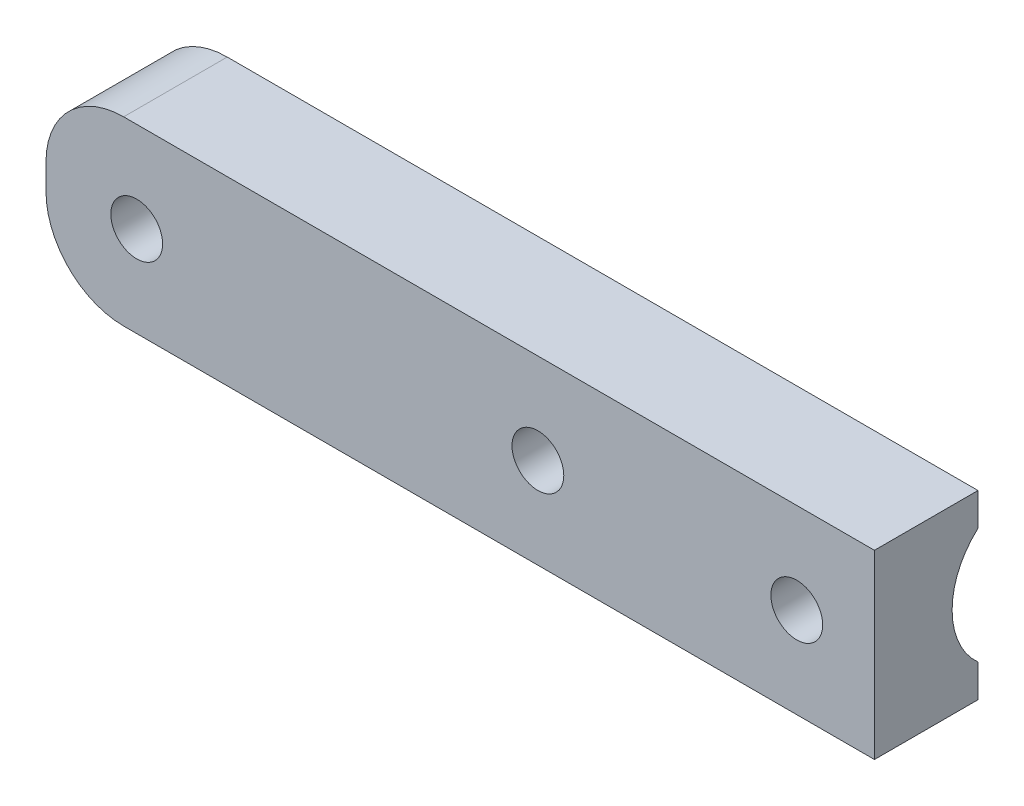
ISO-10303-21;
HEADER;
FILE_DESCRIPTION(('STEP AP214'),'2;1');
FILE_NAME('part.step','',(''),(''),'','','');
FILE_SCHEMA(('AUTOMOTIVE_DESIGN { 1 0 10303 214 1 1 1 1 }'));
ENDSEC;
DATA;
#1=APPLICATION_CONTEXT('core data for automotive mechanical design processes');
#2=APPLICATION_PROTOCOL_DEFINITION('international standard','automotive_design',2000,#1);
#3=PRODUCT_CONTEXT('',#1,'mechanical');
#4=PRODUCT('Part','Part','',(#3));
#5=PRODUCT_RELATED_PRODUCT_CATEGORY('part','',(#4));
#6=PRODUCT_DEFINITION_FORMATION('','',#4);
#7=PRODUCT_DEFINITION_CONTEXT('part definition',#1,'design');
#8=PRODUCT_DEFINITION('design','',#6,#7);
#9=PRODUCT_DEFINITION_SHAPE('','',#8);
#10=(LENGTH_UNIT() NAMED_UNIT(*) SI_UNIT(.MILLI.,.METRE.));
#11=(NAMED_UNIT(*) PLANE_ANGLE_UNIT() SI_UNIT($,.RADIAN.));
#12=(NAMED_UNIT(*) SI_UNIT($,.STERADIAN.) SOLID_ANGLE_UNIT());
#13=UNCERTAINTY_MEASURE_WITH_UNIT(LENGTH_MEASURE(1.E-05),#10,'distance_accuracy_value','');
#14=(GEOMETRIC_REPRESENTATION_CONTEXT(3) GLOBAL_UNCERTAINTY_ASSIGNED_CONTEXT((#13)) GLOBAL_UNIT_ASSIGNED_CONTEXT((#10,
#11,#12)) REPRESENTATION_CONTEXT('',''));
#15=CARTESIAN_POINT('',(0.,0.,0.));
#16=DIRECTION('',(0.,0.,1.));
#17=DIRECTION('',(1.,0.,0.));
#18=AXIS2_PLACEMENT_3D('',#15,#16,#17);
#19=CARTESIAN_POINT('',(0.,0.,6.35));
#20=DIRECTION('',(0.,0.,1.));
#21=DIRECTION('',(1.,0.,0.));
#22=AXIS2_PLACEMENT_3D('',#19,#20,#21);
#23=PLANE('',#22);
#24=CARTESIAN_POINT('',(80.9498,0.,6.35));
#25=DIRECTION('',(0.,0.,1.));
#26=DIRECTION('',(1.,0.,0.));
#27=AXIS2_PLACEMENT_3D('',#24,#25,#26);
#28=CIRCLE('',#27,3.175);
#29=CARTESIAN_POINT('',(84.1248,0.,6.35));
#30=VERTEX_POINT('',#29);
#31=EDGE_CURVE('E128',#30,#30,#28,.T.);
#32=ORIENTED_EDGE('',*,*,#31,.F.);
#33=EDGE_LOOP('',(#32));
#34=FACE_BOUND('',#33,.T.);
#35=DIRECTION('',(0.,-1.,0.));
#36=VECTOR('',#35,1.);
#37=CARTESIAN_POINT('',(-11.1252,11.1125,6.35));
#38=LINE('',#37,#36);
#39=CARTESIAN_POINT('',(-11.1252,1.5875,6.35));
#40=VERTEX_POINT('',#39);
#41=CARTESIAN_POINT('',(-11.1252,-1.5875,6.35));
#42=VERTEX_POINT('',#41);
#43=EDGE_CURVE('E135',#40,#42,#38,.T.);
#44=ORIENTED_EDGE('',*,*,#43,.T.);
#45=CARTESIAN_POINT('',(-1.6002,-1.5875,6.35));
#46=DIRECTION('',(0.,0.,1.));
#47=DIRECTION('',(1.,0.,0.));
#48=AXIS2_PLACEMENT_3D('',#45,#46,#47);
#49=CIRCLE('',#48,9.525);
#50=CARTESIAN_POINT('',(-1.6002,-11.1125,6.35));
#51=VERTEX_POINT('',#50);
#52=EDGE_CURVE('E173',#42,#51,#49,.T.);
#53=ORIENTED_EDGE('',*,*,#52,.T.);
#54=DIRECTION('',(1.,0.,0.));
#55=VECTOR('',#54,1.);
#56=CARTESIAN_POINT('',(-11.1252,-11.1125,6.35));
#57=LINE('',#56,#55);
#58=CARTESIAN_POINT('',(90.4748,-11.1125,6.35));
#59=VERTEX_POINT('',#58);
#60=EDGE_CURVE('E138',#51,#59,#57,.T.);
#61=ORIENTED_EDGE('',*,*,#60,.T.);
#62=DIRECTION('',(0.,1.,0.));
#63=VECTOR('',#62,1.);
#64=CARTESIAN_POINT('',(90.4748,-11.1125,6.35));
#65=LINE('',#64,#63);
#66=CARTESIAN_POINT('',(90.4748,11.1125,6.35));
#67=VERTEX_POINT('',#66);
#68=EDGE_CURVE('E141',#59,#67,#65,.T.);
#69=ORIENTED_EDGE('',*,*,#68,.T.);
#70=DIRECTION('',(-1.,0.,0.));
#71=VECTOR('',#70,1.);
#72=CARTESIAN_POINT('',(90.4748,11.1125,6.35));
#73=LINE('',#72,#71);
#74=CARTESIAN_POINT('',(-1.6002,11.1125,6.35));
#75=VERTEX_POINT('',#74);
#76=EDGE_CURVE('E143',#67,#75,#73,.T.);
#77=ORIENTED_EDGE('',*,*,#76,.T.);
#78=CARTESIAN_POINT('',(-1.6002,1.5875,6.35));
#79=DIRECTION('',(0.,0.,1.));
#80=DIRECTION('',(1.,0.,0.));
#81=AXIS2_PLACEMENT_3D('',#78,#79,#80);
#82=CIRCLE('',#81,9.525);
#83=EDGE_CURVE('E171',#75,#40,#82,.T.);
#84=ORIENTED_EDGE('',*,*,#83,.T.);
#85=EDGE_LOOP('',(#44,#53,#61,#69,#77,#84));
#86=FACE_BOUND('',#85,.T.);
#87=CARTESIAN_POINT('',(0.,0.,6.35));
#88=DIRECTION('',(0.,0.,1.));
#89=DIRECTION('',(1.,0.,0.));
#90=AXIS2_PLACEMENT_3D('',#87,#88,#89);
#91=CIRCLE('',#90,3.175);
#92=CARTESIAN_POINT('',(3.175,0.,6.35));
#93=VERTEX_POINT('',#92);
#94=EDGE_CURVE('E131',#93,#93,#91,.T.);
#95=ORIENTED_EDGE('',*,*,#94,.F.);
#96=EDGE_LOOP('',(#95));
#97=FACE_BOUND('',#96,.T.);
#98=CARTESIAN_POINT('',(49.1998,0.,6.35));
#99=DIRECTION('',(0.,0.,1.));
#100=DIRECTION('',(1.,0.,0.));
#101=AXIS2_PLACEMENT_3D('',#98,#99,#100);
#102=CIRCLE('',#101,3.17500000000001);
#103=CARTESIAN_POINT('',(52.3748,0.,6.35));
#104=VERTEX_POINT('',#103);
#105=EDGE_CURVE('E116',#104,#104,#102,.T.);
#106=ORIENTED_EDGE('',*,*,#105,.F.);
#107=EDGE_LOOP('',(#106));
#108=FACE_BOUND('',#107,.T.);
#109=ADVANCED_FACE('F33',(#34,#86,#97,#108),#23,.T.);
#110=CARTESIAN_POINT('',(0.,0.,-6.35));
#111=DIRECTION('',(0.,0.,1.));
#112=DIRECTION('',(1.,0.,0.));
#113=AXIS2_PLACEMENT_3D('',#110,#111,#112);
#114=PLANE('',#113);
#115=CARTESIAN_POINT('',(0.,0.,-6.35));
#116=DIRECTION('',(0.,0.,1.));
#117=DIRECTION('',(1.,0.,0.));
#118=AXIS2_PLACEMENT_3D('',#115,#116,#117);
#119=CIRCLE('',#118,9.525);
#120=CARTESIAN_POINT('',(9.525,0.,-6.35));
#121=VERTEX_POINT('',#120);
#122=EDGE_CURVE('E37',#121,#121,#119,.T.);
#123=ORIENTED_EDGE('',*,*,#122,.T.);
#124=EDGE_LOOP('',(#123));
#125=FACE_BOUND('',#124,.T.);
#126=DIRECTION('',(0.,1.,0.));
#127=VECTOR('',#126,1.);
#128=CARTESIAN_POINT('',(39.6748,0.,-6.35));
#129=LINE('',#128,#127);
#130=CARTESIAN_POINT('',(39.6748,-7.09951582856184,-6.35));
#131=VERTEX_POINT('',#130);
#132=CARTESIAN_POINT('',(39.6748,7.09951582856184,-6.35));
#133=VERTEX_POINT('',#132);
#134=EDGE_CURVE('E11',#131,#133,#129,.T.);
#135=ORIENTED_EDGE('',*,*,#134,.F.);
#136=DIRECTION('',(1.,0.,0.));
#137=VECTOR('',#136,1.);
#138=CARTESIAN_POINT('',(39.6748,-7.09951582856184,-6.35));
#139=LINE('',#138,#137);
#140=CARTESIAN_POINT('',(90.4748,-7.09951582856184,-6.35));
#141=VERTEX_POINT('',#140);
#142=EDGE_CURVE('E106',#131,#141,#139,.T.);
#143=ORIENTED_EDGE('',*,*,#142,.T.);
#144=DIRECTION('',(0.,1.,0.));
#145=VECTOR('',#144,1.);
#146=CARTESIAN_POINT('',(90.4748,-11.1125,-6.35));
#147=LINE('',#146,#145);
#148=CARTESIAN_POINT('',(90.4748,-11.1125,-6.35));
#149=VERTEX_POINT('',#148);
#150=EDGE_CURVE('E150',#149,#141,#147,.T.);
#151=ORIENTED_EDGE('',*,*,#150,.F.);
#152=DIRECTION('',(1.,0.,0.));
#153=VECTOR('',#152,1.);
#154=CARTESIAN_POINT('',(-11.1252,-11.1125,-6.35));
#155=LINE('',#154,#153);
#156=CARTESIAN_POINT('',(-1.6002,-11.1125,-6.35));
#157=VERTEX_POINT('',#156);
#158=EDGE_CURVE('E148',#157,#149,#155,.T.);
#159=ORIENTED_EDGE('',*,*,#158,.F.);
#160=CARTESIAN_POINT('',(-1.6002,-1.5875,-6.35));
#161=DIRECTION('',(0.,0.,1.));
#162=DIRECTION('',(1.,0.,0.));
#163=AXIS2_PLACEMENT_3D('',#160,#161,#162);
#164=CIRCLE('',#163,9.525);
#165=CARTESIAN_POINT('',(-11.1252,-1.5875,-6.35));
#166=VERTEX_POINT('',#165);
#167=EDGE_CURVE('E164',#157,#166,#164,.F.);
#168=ORIENTED_EDGE('',*,*,#167,.T.);
#169=DIRECTION('',(0.,-1.,0.));
#170=VECTOR('',#169,1.);
#171=CARTESIAN_POINT('',(-11.1252,11.1125,-6.35));
#172=LINE('',#171,#170);
#173=CARTESIAN_POINT('',(-11.1252,1.5875,-6.35));
#174=VERTEX_POINT('',#173);
#175=EDGE_CURVE('E134',#174,#166,#172,.T.);
#176=ORIENTED_EDGE('',*,*,#175,.F.);
#177=CARTESIAN_POINT('',(-1.6002,1.5875,-6.35));
#178=DIRECTION('',(0.,0.,1.));
#179=DIRECTION('',(1.,0.,0.));
#180=AXIS2_PLACEMENT_3D('',#177,#178,#179);
#181=CIRCLE('',#180,9.525);
#182=CARTESIAN_POINT('',(-1.6002,11.1125,-6.35));
#183=VERTEX_POINT('',#182);
#184=EDGE_CURVE('E162',#174,#183,#181,.F.);
#185=ORIENTED_EDGE('',*,*,#184,.T.);
#186=DIRECTION('',(-1.,0.,0.));
#187=VECTOR('',#186,1.);
#188=CARTESIAN_POINT('',(90.4748,11.1125,-6.35));
#189=LINE('',#188,#187);
#190=CARTESIAN_POINT('',(90.4748,11.1125,-6.35));
#191=VERTEX_POINT('',#190);
#192=EDGE_CURVE('E139',#191,#183,#189,.T.);
#193=ORIENTED_EDGE('',*,*,#192,.F.);
#194=CARTESIAN_POINT('',(90.4748,7.09951582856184,-6.35));
#195=VERTEX_POINT('',#194);
#196=EDGE_CURVE('E113',#195,#191,#147,.T.);
#197=ORIENTED_EDGE('',*,*,#196,.F.);
#198=DIRECTION('',(1.,0.,0.));
#199=VECTOR('',#198,1.);
#200=CARTESIAN_POINT('',(39.6748,7.09951582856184,-6.35));
#201=LINE('',#200,#199);
#202=EDGE_CURVE('E50',#195,#133,#201,.F.);
#203=ORIENTED_EDGE('',*,*,#202,.T.);
#204=EDGE_LOOP('',(#135,#143,#151,#159,#168,#176,#185,#193,#197,#203));
#205=FACE_BOUND('',#204,.T.);
#206=ADVANCED_FACE('F111',(#125,#205),#114,.F.);
#207=CARTESIAN_POINT('',(-11.1252,11.1125,6.35));
#208=DIRECTION('',(1.,0.,0.));
#209=DIRECTION('',(0.,0.,-1.));
#210=AXIS2_PLACEMENT_3D('',#207,#208,#209);
#211=PLANE('',#210);
#212=ORIENTED_EDGE('',*,*,#175,.T.);
#213=DIRECTION('',(0.,0.,-1.));
#214=VECTOR('',#213,1.);
#215=CARTESIAN_POINT('',(-11.1252,-1.5875,6.35));
#216=LINE('',#215,#214);
#217=EDGE_CURVE('E169',#166,#42,#216,.F.);
#218=ORIENTED_EDGE('',*,*,#217,.T.);
#219=ORIENTED_EDGE('',*,*,#43,.F.);
#220=DIRECTION('',(0.,0.,-1.));
#221=VECTOR('',#220,1.);
#222=CARTESIAN_POINT('',(-11.1252,1.5875,6.35));
#223=LINE('',#222,#221);
#224=EDGE_CURVE('E166',#40,#174,#223,.T.);
#225=ORIENTED_EDGE('',*,*,#224,.T.);
#226=EDGE_LOOP('',(#212,#218,#219,#225));
#227=FACE_BOUND('',#226,.T.);
#228=ADVANCED_FACE('F206',(#227),#211,.F.);
#229=CARTESIAN_POINT('',(-11.1252,-11.1125,6.35));
#230=DIRECTION('',(0.,1.,0.));
#231=DIRECTION('',(0.,0.,1.));
#232=AXIS2_PLACEMENT_3D('',#229,#230,#231);
#233=PLANE('',#232);
#234=ORIENTED_EDGE('',*,*,#60,.F.);
#235=DIRECTION('',(0.,0.,-1.));
#236=VECTOR('',#235,1.);
#237=CARTESIAN_POINT('',(-1.6002,-11.1125,6.35));
#238=LINE('',#237,#236);
#239=EDGE_CURVE('E159',#51,#157,#238,.T.);
#240=ORIENTED_EDGE('',*,*,#239,.T.);
#241=ORIENTED_EDGE('',*,*,#158,.T.);
#242=DIRECTION('',(0.,0.,-1.));
#243=VECTOR('',#242,1.);
#244=CARTESIAN_POINT('',(90.4748,-11.1125,6.35));
#245=LINE('',#244,#243);
#246=EDGE_CURVE('E156',#59,#149,#245,.T.);
#247=ORIENTED_EDGE('',*,*,#246,.F.);
#248=EDGE_LOOP('',(#234,#240,#241,#247));
#249=FACE_BOUND('',#248,.T.);
#250=ADVANCED_FACE('F220',(#249),#233,.F.);
#251=CARTESIAN_POINT('',(90.4748,-11.1125,6.35));
#252=DIRECTION('',(-1.,0.,0.));
#253=DIRECTION('',(0.,0.,1.));
#254=AXIS2_PLACEMENT_3D('',#251,#252,#253);
#255=PLANE('',#254);
#256=ORIENTED_EDGE('',*,*,#150,.T.);
#257=CARTESIAN_POINT('',(90.4748,0.,-12.7));
#258=DIRECTION('',(1.,0.,0.));
#259=DIRECTION('',(0.,0.,-1.));
#260=AXIS2_PLACEMENT_3D('',#257,#258,#259);
#261=CIRCLE('',#260,9.525);
#262=EDGE_CURVE('E108',#195,#141,#261,.T.);
#263=ORIENTED_EDGE('',*,*,#262,.F.);
#264=ORIENTED_EDGE('',*,*,#196,.T.);
#265=DIRECTION('',(0.,0.,-1.));
#266=VECTOR('',#265,1.);
#267=CARTESIAN_POINT('',(90.4748,11.1125,6.35));
#268=LINE('',#267,#266);
#269=EDGE_CURVE('E145',#67,#191,#268,.T.);
#270=ORIENTED_EDGE('',*,*,#269,.F.);
#271=ORIENTED_EDGE('',*,*,#68,.F.);
#272=ORIENTED_EDGE('',*,*,#246,.T.);
#273=EDGE_LOOP('',(#256,#263,#264,#270,#271,#272));
#274=FACE_BOUND('',#273,.T.);
#275=ADVANCED_FACE('F217',(#274),#255,.F.);
#276=CARTESIAN_POINT('',(90.4748,11.1125,6.35));
#277=DIRECTION('',(0.,-1.,0.));
#278=DIRECTION('',(0.,0.,-1.));
#279=AXIS2_PLACEMENT_3D('',#276,#277,#278);
#280=PLANE('',#279);
#281=ORIENTED_EDGE('',*,*,#192,.T.);
#282=DIRECTION('',(0.,0.,-1.));
#283=VECTOR('',#282,1.);
#284=CARTESIAN_POINT('',(-1.6002,11.1125,6.35));
#285=LINE('',#284,#283);
#286=EDGE_CURVE('E42',#183,#75,#285,.F.);
#287=ORIENTED_EDGE('',*,*,#286,.T.);
#288=ORIENTED_EDGE('',*,*,#76,.F.);
#289=ORIENTED_EDGE('',*,*,#269,.T.);
#290=EDGE_LOOP('',(#281,#287,#288,#289));
#291=FACE_BOUND('',#290,.T.);
#292=ADVANCED_FACE('F214',(#291),#280,.F.);
#293=CARTESIAN_POINT('',(0.,0.,6.35));
#294=DIRECTION('',(0.,0.,-1.));
#295=DIRECTION('',(-1.,0.,0.));
#296=AXIS2_PLACEMENT_3D('',#293,#294,#295);
#297=CYLINDRICAL_SURFACE('',#296,3.175);
#298=CARTESIAN_POINT('',(0.,0.,-2.54));
#299=DIRECTION('',(0.,0.,1.));
#300=DIRECTION('',(1.,0.,0.));
#301=AXIS2_PLACEMENT_3D('',#298,#299,#300);
#302=CIRCLE('',#301,3.175);
#303=CARTESIAN_POINT('',(3.175,0.,-2.54));
#304=VERTEX_POINT('',#303);
#305=EDGE_CURVE('E252',#304,#304,#302,.T.);
#306=ORIENTED_EDGE('',*,*,#305,.F.);
#307=EDGE_LOOP('',(#306));
#308=FACE_BOUND('',#307,.T.);
#309=ORIENTED_EDGE('',*,*,#94,.T.);
#310=EDGE_LOOP('',(#309));
#311=FACE_BOUND('',#310,.T.);
#312=ADVANCED_FACE('F212',(#308,#311),#297,.F.);
#313=CARTESIAN_POINT('',(80.9498,0.,6.35));
#314=DIRECTION('',(0.,0.,-1.));
#315=DIRECTION('',(-1.,0.,0.));
#316=AXIS2_PLACEMENT_3D('',#313,#314,#315);
#317=CYLINDRICAL_SURFACE('',#316,3.175);
#318=CARTESIAN_POINT('',(77.7748,0.,-3.17499999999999));
#319=CARTESIAN_POINT('',(77.774799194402,-0.173238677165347,-3.17499951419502));
#320=CARTESIAN_POINT('',(77.7890248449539,-0.346472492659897,-3.17976981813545));
#321=CARTESIAN_POINT('',(77.8453774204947,-0.687837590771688,-3.19832957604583));
#322=CARTESIAN_POINT('',(77.8875072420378,-0.855968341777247,-3.21211996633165));
#323=CARTESIAN_POINT('',(77.9980635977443,-1.18215660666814,-3.24722147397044));
#324=CARTESIAN_POINT('',(78.0664461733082,-1.34023044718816,-3.2685200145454));
#325=CARTESIAN_POINT('',(78.2273682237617,-1.64266542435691,-3.31646384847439));
#326=CARTESIAN_POINT('',(78.3199124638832,-1.78702384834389,-3.34311019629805));
#327=CARTESIAN_POINT('',(78.5298969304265,-2.0629298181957,-3.39997750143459));
#328=CARTESIAN_POINT('',(78.6480241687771,-2.19393674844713,-3.43028408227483));
#329=CARTESIAN_POINT('',(78.9043607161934,-2.43469379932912,-3.49058500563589));
#330=CARTESIAN_POINT('',(79.042574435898,-2.54443923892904,-3.52057927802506));
#331=CARTESIAN_POINT('',(79.3400277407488,-2.74264419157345,-3.57780169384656));
#332=CARTESIAN_POINT('',(79.4997576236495,-2.83040092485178,-3.6049255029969));
#333=CARTESIAN_POINT('',(79.8327590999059,-2.97757492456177,-3.65203405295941));
#334=CARTESIAN_POINT('',(80.0060265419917,-3.03700083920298,-3.67202097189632));
#335=CARTESIAN_POINT('',(80.3550374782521,-3.12379824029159,-3.70169112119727));
#336=CARTESIAN_POINT('',(80.5305006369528,-3.15218269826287,-3.71169895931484));
#337=CARTESIAN_POINT('',(80.8839624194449,-3.17925806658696,-3.72123790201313));
#338=CARTESIAN_POINT('',(81.0619602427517,-3.17795815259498,-3.72077224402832));
#339=CARTESIAN_POINT('',(81.4067988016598,-3.14648819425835,-3.70970127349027));
#340=CARTESIAN_POINT('',(81.5737776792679,-3.11764017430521,-3.69956029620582));
#341=CARTESIAN_POINT('',(81.9003741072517,-3.0340495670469,-3.6710411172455));
#342=CARTESIAN_POINT('',(82.0599907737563,-2.97930387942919,-3.65266192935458));
#343=CARTESIAN_POINT('',(82.3703354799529,-2.84460650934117,-3.60940632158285));
#344=CARTESIAN_POINT('',(82.5208789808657,-2.76426310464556,-3.58443003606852));
#345=CARTESIAN_POINT('',(82.8067651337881,-2.58092291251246,-3.53083626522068));
#346=CARTESIAN_POINT('',(82.9421033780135,-2.47791958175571,-3.50221772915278));
#347=CARTESIAN_POINT('',(83.2011658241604,-2.2458341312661,-3.44273729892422));
#348=CARTESIAN_POINT('',(83.3239148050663,-2.11567125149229,-3.41183628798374));
#349=CARTESIAN_POINT('',(83.5460967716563,-1.83622813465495,-3.35257970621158));
#350=CARTESIAN_POINT('',(83.6455275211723,-1.68694606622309,-3.32422437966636));
#351=CARTESIAN_POINT('',(83.8190357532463,-1.3714336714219,-3.27288182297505));
#352=CARTESIAN_POINT('',(83.8928519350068,-1.20504990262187,-3.24995063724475));
#353=CARTESIAN_POINT('',(84.0111450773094,-0.861279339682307,-3.21244699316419));
#354=CARTESIAN_POINT('',(84.0556322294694,-0.683896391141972,-3.19787163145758));
#355=CARTESIAN_POINT('',(84.112276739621,-0.331418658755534,-3.17920284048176));
#356=CARTESIAN_POINT('',(84.1257518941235,-0.156557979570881,-3.17468244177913));
#357=CARTESIAN_POINT('',(84.1237437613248,0.192960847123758,-3.17535233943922));
#358=CARTESIAN_POINT('',(84.1082653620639,0.367619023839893,-3.18054099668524));
#359=CARTESIAN_POINT('',(84.0498321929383,0.706500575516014,-3.19976421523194));
#360=CARTESIAN_POINT('',(84.0076862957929,0.870879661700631,-3.21353819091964));
#361=CARTESIAN_POINT('',(83.8981258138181,1.19016766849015,-3.24828386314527));
#362=CARTESIAN_POINT('',(83.8307080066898,1.34507537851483,-3.26925647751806));
#363=CARTESIAN_POINT('',(83.6705513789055,1.64556534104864,-3.31695643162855));
#364=CARTESIAN_POINT('',(83.5771931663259,1.79079512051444,-3.34382063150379));
#365=CARTESIAN_POINT('',(83.3685335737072,2.06395583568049,-3.40025818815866));
#366=CARTESIAN_POINT('',(83.2532254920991,2.19188146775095,-3.42983237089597));
#367=CARTESIAN_POINT('',(82.9977424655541,2.432851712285,-3.49006007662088));
#368=CARTESIAN_POINT('',(82.8566757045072,2.54495607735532,-3.52070158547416));
#369=CARTESIAN_POINT('',(82.5570752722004,2.74401763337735,-3.578225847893));
#370=CARTESIAN_POINT('',(82.3985414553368,2.83097461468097,-3.60510857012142));
#371=CARTESIAN_POINT('',(82.0684381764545,2.97687025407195,-3.65180906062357));
#372=CARTESIAN_POINT('',(81.8968958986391,3.03586556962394,-3.67164109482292));
#373=CARTESIAN_POINT('',(81.5454977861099,3.12386556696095,-3.70170607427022));
#374=CARTESIAN_POINT('',(81.3656457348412,3.15288375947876,-3.71194334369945));
#375=CARTESIAN_POINT('',(81.0126742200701,3.17905219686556,-3.72116798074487));
#376=CARTESIAN_POINT('',(80.8396835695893,3.17776306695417,-3.72070629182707));
#377=CARTESIAN_POINT('',(80.4965208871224,3.1471942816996,-3.70994718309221));
#378=CARTESIAN_POINT('',(80.3263486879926,3.11791629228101,-3.69965034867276));
#379=CARTESIAN_POINT('',(79.9968692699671,3.03330550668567,-3.67079135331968));
#380=CARTESIAN_POINT('',(79.8374170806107,2.97847812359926,-3.65238988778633));
#381=CARTESIAN_POINT('',(79.529852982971,2.84473448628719,-3.60945433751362));
#382=CARTESIAN_POINT('',(79.3817436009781,2.76581288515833,-3.58491889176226));
#383=CARTESIAN_POINT('',(79.0940643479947,2.58210269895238,-3.53114517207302));
#384=CARTESIAN_POINT('',(78.9551491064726,2.47633567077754,-3.50174840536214));
#385=CARTESIAN_POINT('',(78.6965348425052,2.24359115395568,-3.44222843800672));
#386=CARTESIAN_POINT('',(78.5768412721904,2.11660766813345,-3.41210503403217));
#387=CARTESIAN_POINT('',(78.3553664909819,1.83909194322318,-3.35311653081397));
#388=CARTESIAN_POINT('',(78.2544651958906,1.68783480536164,-3.3243462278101));
#389=CARTESIAN_POINT('',(78.0796303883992,1.36955960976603,-3.27259978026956));
#390=CARTESIAN_POINT('',(78.0056899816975,1.2025455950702,-3.24962215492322));
#391=CARTESIAN_POINT('',(77.8899838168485,0.865167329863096,-3.21292489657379));
#392=CARTESIAN_POINT('',(77.8469281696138,0.695286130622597,-3.1988375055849));
#393=CARTESIAN_POINT('',(77.7893406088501,0.350267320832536,-3.17987657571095));
#394=CARTESIAN_POINT('',(77.7748008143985,0.175131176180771,-3.17500049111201));
#395=CARTESIAN_POINT('',(77.7748,0.,-3.17499999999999));
#396=B_SPLINE_CURVE_WITH_KNOTS('',3,(#318,#319,#320,#321,#322,#323,#324,#325,#326,#327,#328,
#329,#330,#331,#332,#333,#334,#335,#336,#337,#338,#339,#340,#341,#342,#343,#344,#345,#346,#347,
#348,#349,#350,#351,#352,#353,#354,#355,#356,#357,#358,#359,#360,#361,#362,#363,#364,#365,#366,
#367,#368,#369,#370,#371,#372,#373,#374,#375,#376,#377,#378,#379,#380,#381,#382,#383,#384,#385,
#386,#387,#388,#389,#390,#391,#392,#393,#394,#395),.UNSPECIFIED.,.T.,.F.,(4,2,2,2,2,2,2,2,2,2,2,
2,2,2,2,2,2,2,2,2,2,2,2,2,2,2,2,2,2,2,2,2,2,2,2,2,2,2,4),(0.,0.519071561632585,1.03819701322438,
1.55645698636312,2.07481924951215,2.60936372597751,3.14402575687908,3.69406121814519,
4.24392866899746,4.77526114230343,5.30642937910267,5.81332424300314,6.32027980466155,
6.83539943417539,7.35066800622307,7.89283745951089,8.43505888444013,8.98265937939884,
9.53006948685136,10.0537512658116,10.5773446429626,11.0857715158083,11.5942632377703,
12.1161301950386,12.638156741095,13.1839024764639,13.7296527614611,14.274292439,
14.8186865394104,15.3351123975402,15.8515075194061,16.3580948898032,16.8647947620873,
17.3936046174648,17.92256420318,18.4721392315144,19.0215736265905,19.5464607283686,
20.0712027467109),.UNSPECIFIED.);
#397=CARTESIAN_POINT('',(77.7748,0.,-3.17499999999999));
#398=VERTEX_POINT('',#397);
#399=EDGE_CURVE('E114',#398,#398,#396,.T.);
#400=ORIENTED_EDGE('',*,*,#399,.F.);
#401=EDGE_LOOP('',(#400));
#402=FACE_BOUND('',#401,.T.);
#403=ORIENTED_EDGE('',*,*,#31,.T.);
#404=EDGE_LOOP('',(#403));
#405=FACE_BOUND('',#404,.T.);
#406=ADVANCED_FACE('F235',(#402,#405),#317,.F.);
#407=CARTESIAN_POINT('',(49.1998,0.,6.35));
#408=DIRECTION('',(0.,0.,-1.));
#409=DIRECTION('',(-1.,0.,0.));
#410=AXIS2_PLACEMENT_3D('',#407,#408,#409);
#411=CYLINDRICAL_SURFACE('',#410,3.17500000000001);
#412=CARTESIAN_POINT('',(46.0248,0.,-3.17499999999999));
#413=CARTESIAN_POINT('',(46.024799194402,-0.173238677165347,-3.17499951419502));
#414=CARTESIAN_POINT('',(46.0390248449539,-0.346472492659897,-3.17976981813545));
#415=CARTESIAN_POINT('',(46.0953774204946,-0.687837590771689,-3.19832957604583));
#416=CARTESIAN_POINT('',(46.1375072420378,-0.855968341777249,-3.21211996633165));
#417=CARTESIAN_POINT('',(46.2480635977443,-1.18215660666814,-3.24722147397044));
#418=CARTESIAN_POINT('',(46.3164461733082,-1.34023044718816,-3.2685200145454));
#419=CARTESIAN_POINT('',(46.4773682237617,-1.64266542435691,-3.3164638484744));
#420=CARTESIAN_POINT('',(46.5699124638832,-1.7870238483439,-3.34311019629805));
#421=CARTESIAN_POINT('',(46.7798969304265,-2.0629298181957,-3.39997750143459));
#422=CARTESIAN_POINT('',(46.898024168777,-2.19393674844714,-3.43028408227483));
#423=CARTESIAN_POINT('',(47.1543607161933,-2.43469379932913,-3.49058500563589));
#424=CARTESIAN_POINT('',(47.292574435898,-2.54443923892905,-3.52057927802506));
#425=CARTESIAN_POINT('',(47.5900277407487,-2.74264419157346,-3.57780169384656));
#426=CARTESIAN_POINT('',(47.7497576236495,-2.83040092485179,-3.6049255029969));
#427=CARTESIAN_POINT('',(48.0827590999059,-2.97757492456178,-3.65203405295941));
#428=CARTESIAN_POINT('',(48.2560265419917,-3.03700083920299,-3.67202097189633));
#429=CARTESIAN_POINT('',(48.605037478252,-3.1237982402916,-3.70169112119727));
#430=CARTESIAN_POINT('',(48.7805006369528,-3.15218269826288,-3.71169895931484));
#431=CARTESIAN_POINT('',(49.1339624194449,-3.17925806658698,-3.72123790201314));
#432=CARTESIAN_POINT('',(49.3119602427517,-3.17795815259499,-3.72077224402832));
#433=CARTESIAN_POINT('',(49.6567988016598,-3.14648819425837,-3.70970127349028));
#434=CARTESIAN_POINT('',(49.8237776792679,-3.11764017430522,-3.69956029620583));
#435=CARTESIAN_POINT('',(50.1503741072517,-3.03404956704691,-3.67104111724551));
#436=CARTESIAN_POINT('',(50.3099907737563,-2.9793038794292,-3.65266192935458));
#437=CARTESIAN_POINT('',(50.6203354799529,-2.84460650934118,-3.60940632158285));
#438=CARTESIAN_POINT('',(50.7708789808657,-2.76426310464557,-3.58443003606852));
#439=CARTESIAN_POINT('',(51.0567651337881,-2.58092291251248,-3.53083626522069));
#440=CARTESIAN_POINT('',(51.1921033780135,-2.47791958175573,-3.50221772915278));
#441=CARTESIAN_POINT('',(51.4511658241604,-2.24583413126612,-3.44273729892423));
#442=CARTESIAN_POINT('',(51.5739148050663,-2.1156712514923,-3.41183628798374));
#443=CARTESIAN_POINT('',(51.7960967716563,-1.83622813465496,-3.35257970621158));
#444=CARTESIAN_POINT('',(51.8955275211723,-1.68694606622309,-3.32422437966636));
#445=CARTESIAN_POINT('',(52.0690357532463,-1.37143367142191,-3.27288182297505));
#446=CARTESIAN_POINT('',(52.1428519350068,-1.20504990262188,-3.24995063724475));
#447=CARTESIAN_POINT('',(52.2611450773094,-0.861279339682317,-3.21244699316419));
#448=CARTESIAN_POINT('',(52.3056322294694,-0.683896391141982,-3.19787163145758));
#449=CARTESIAN_POINT('',(52.362276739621,-0.331418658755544,-3.17920284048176));
#450=CARTESIAN_POINT('',(52.3757518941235,-0.15655797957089,-3.17468244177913));
#451=CARTESIAN_POINT('',(52.3737437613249,0.192960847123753,-3.17535233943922));
#452=CARTESIAN_POINT('',(52.3582653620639,0.367619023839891,-3.18054099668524));
#453=CARTESIAN_POINT('',(52.2998321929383,0.706500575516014,-3.19976421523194));
#454=CARTESIAN_POINT('',(52.2576862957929,0.870879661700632,-3.21353819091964));
#455=CARTESIAN_POINT('',(52.1481258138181,1.19016766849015,-3.24828386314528));
#456=CARTESIAN_POINT('',(52.0807080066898,1.34507537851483,-3.26925647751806));
#457=CARTESIAN_POINT('',(51.9205513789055,1.64556534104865,-3.31695643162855));
#458=CARTESIAN_POINT('',(51.8271931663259,1.79079512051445,-3.34382063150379));
#459=CARTESIAN_POINT('',(51.6185335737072,2.06395583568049,-3.40025818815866));
#460=CARTESIAN_POINT('',(51.5032254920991,2.19188146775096,-3.42983237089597));
#461=CARTESIAN_POINT('',(51.2477424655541,2.43285171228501,-3.49006007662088));
#462=CARTESIAN_POINT('',(51.1066757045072,2.54495607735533,-3.52070158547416));
#463=CARTESIAN_POINT('',(50.8070752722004,2.74401763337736,-3.578225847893));
#464=CARTESIAN_POINT('',(50.6485414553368,2.83097461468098,-3.60510857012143));
#465=CARTESIAN_POINT('',(50.3184381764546,2.97687025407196,-3.65180906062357));
#466=CARTESIAN_POINT('',(50.1468958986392,3.03586556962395,-3.67164109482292));
#467=CARTESIAN_POINT('',(49.7954977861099,3.12386556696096,-3.70170607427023));
#468=CARTESIAN_POINT('',(49.6156457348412,3.15288375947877,-3.71194334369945));
#469=CARTESIAN_POINT('',(49.2626742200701,3.17905219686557,-3.72116798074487));
#470=CARTESIAN_POINT('',(49.0896835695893,3.17776306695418,-3.72070629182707));
#471=CARTESIAN_POINT('',(48.7465208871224,3.14719428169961,-3.70994718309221));
#472=CARTESIAN_POINT('',(48.5763486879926,3.11791629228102,-3.69965034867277));
#473=CARTESIAN_POINT('',(48.2468692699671,3.03330550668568,-3.67079135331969));
#474=CARTESIAN_POINT('',(48.0874170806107,2.97847812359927,-3.65238988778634));
#475=CARTESIAN_POINT('',(47.779852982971,2.84473448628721,-3.60945433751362));
#476=CARTESIAN_POINT('',(47.6317436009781,2.76581288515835,-3.58491889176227));
#477=CARTESIAN_POINT('',(47.3440643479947,2.5821026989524,-3.53114517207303));
#478=CARTESIAN_POINT('',(47.2051491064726,2.47633567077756,-3.50174840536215));
#479=CARTESIAN_POINT('',(46.9465348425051,2.2435911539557,-3.44222843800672));
#480=CARTESIAN_POINT('',(46.8268412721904,2.11660766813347,-3.41210503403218));
#481=CARTESIAN_POINT('',(46.6053664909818,1.8390919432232,-3.35311653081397));
#482=CARTESIAN_POINT('',(46.5044651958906,1.68783480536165,-3.3243462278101));
#483=CARTESIAN_POINT('',(46.3296303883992,1.36955960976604,-3.27259978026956));
#484=CARTESIAN_POINT('',(46.2556899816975,1.20254559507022,-3.24962215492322));
#485=CARTESIAN_POINT('',(46.1399838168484,0.865167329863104,-3.21292489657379));
#486=CARTESIAN_POINT('',(46.0969281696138,0.695286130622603,-3.1988375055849));
#487=CARTESIAN_POINT('',(46.0393406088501,0.350267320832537,-3.17987657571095));
#488=CARTESIAN_POINT('',(46.0248008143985,0.175131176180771,-3.17500049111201));
#489=CARTESIAN_POINT('',(46.0248,0.,-3.17499999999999));
#490=B_SPLINE_CURVE_WITH_KNOTS('',3,(#412,#413,#414,#415,#416,#417,#418,#419,#420,#421,#422,
#423,#424,#425,#426,#427,#428,#429,#430,#431,#432,#433,#434,#435,#436,#437,#438,#439,#440,#441,
#442,#443,#444,#445,#446,#447,#448,#449,#450,#451,#452,#453,#454,#455,#456,#457,#458,#459,#460,
#461,#462,#463,#464,#465,#466,#467,#468,#469,#470,#471,#472,#473,#474,#475,#476,#477,#478,#479,
#480,#481,#482,#483,#484,#485,#486,#487,#488,#489),.UNSPECIFIED.,.T.,.F.,(4,2,2,2,2,2,2,2,2,2,2,
2,2,2,2,2,2,2,2,2,2,2,2,2,2,2,2,2,2,2,2,2,2,2,2,2,2,2,4),(0.,0.519071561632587,1.03819701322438,
1.55645698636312,2.07481924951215,2.60936372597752,3.1440257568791,3.6940612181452,
4.24392866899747,4.77526114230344,5.30642937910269,5.81332424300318,6.32027980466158,
6.83539943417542,7.3506680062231,7.89283745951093,8.43505888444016,8.98265937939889,
9.5300694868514,10.0537512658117,10.5773446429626,11.0857715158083,11.5942632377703,
12.1161301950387,12.6381567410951,13.1839024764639,13.7296527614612,14.274292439,
14.8186865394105,15.3351123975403,15.8515075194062,16.3580948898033,16.8647947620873,
17.3936046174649,17.92256420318,18.4721392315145,19.0215736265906,19.5464607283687,
20.071202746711),.UNSPECIFIED.);
#491=CARTESIAN_POINT('',(46.0248,0.,-3.17499999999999));
#492=VERTEX_POINT('',#491);
#493=EDGE_CURVE('E107',#492,#492,#490,.T.);
#494=ORIENTED_EDGE('',*,*,#493,.F.);
#495=EDGE_LOOP('',(#494));
#496=FACE_BOUND('',#495,.T.);
#497=ORIENTED_EDGE('',*,*,#105,.T.);
#498=EDGE_LOOP('',(#497));
#499=FACE_BOUND('',#498,.T.);
#500=ADVANCED_FACE('F180',(#496,#499),#411,.F.);
#501=CARTESIAN_POINT('',(-1.6002,-1.5875,6.35));
#502=DIRECTION('',(0.,0.,-1.));
#503=DIRECTION('',(-1.,0.,0.));
#504=AXIS2_PLACEMENT_3D('',#501,#502,#503);
#505=CYLINDRICAL_SURFACE('',#504,9.525);
#506=ORIENTED_EDGE('',*,*,#52,.F.);
#507=ORIENTED_EDGE('',*,*,#217,.F.);
#508=ORIENTED_EDGE('',*,*,#167,.F.);
#509=ORIENTED_EDGE('',*,*,#239,.F.);
#510=EDGE_LOOP('',(#506,#507,#508,#509));
#511=FACE_BOUND('',#510,.T.);
#512=ADVANCED_FACE('F227',(#511),#505,.T.);
#513=CARTESIAN_POINT('',(-1.6002,1.5875,6.35));
#514=DIRECTION('',(0.,0.,-1.));
#515=DIRECTION('',(-1.,0.,0.));
#516=AXIS2_PLACEMENT_3D('',#513,#514,#515);
#517=CYLINDRICAL_SURFACE('',#516,9.525);
#518=ORIENTED_EDGE('',*,*,#83,.F.);
#519=ORIENTED_EDGE('',*,*,#286,.F.);
#520=ORIENTED_EDGE('',*,*,#184,.F.);
#521=ORIENTED_EDGE('',*,*,#224,.F.);
#522=EDGE_LOOP('',(#518,#519,#520,#521));
#523=FACE_BOUND('',#522,.T.);
#524=ADVANCED_FACE('F35',(#523),#517,.T.);
#525=CARTESIAN_POINT('',(39.6748,0.,-12.7));
#526=DIRECTION('',(1.,0.,0.));
#527=DIRECTION('',(0.,0.,-1.));
#528=AXIS2_PLACEMENT_3D('',#525,#526,#527);
#529=PLANE('',#528);
#530=ORIENTED_EDGE('',*,*,#134,.T.);
#531=CARTESIAN_POINT('',(39.6748,0.,-12.7));
#532=DIRECTION('',(1.,0.,0.));
#533=DIRECTION('',(0.,0.,-1.));
#534=AXIS2_PLACEMENT_3D('',#531,#532,#533);
#535=CIRCLE('',#534,9.525);
#536=EDGE_CURVE('E102',#133,#131,#535,.T.);
#537=ORIENTED_EDGE('',*,*,#536,.T.);
#538=EDGE_LOOP('',(#530,#537));
#539=FACE_BOUND('',#538,.T.);
#540=ADVANCED_FACE('F101',(#539),#529,.T.);
#541=CARTESIAN_POINT('',(39.6748,0.,-12.7));
#542=DIRECTION('',(1.,0.,0.));
#543=DIRECTION('',(0.,0.,-1.));
#544=AXIS2_PLACEMENT_3D('',#541,#542,#543);
#545=CYLINDRICAL_SURFACE('',#544,9.525);
#546=ORIENTED_EDGE('',*,*,#493,.T.);
#547=EDGE_LOOP('',(#546));
#548=FACE_BOUND('',#547,.T.);
#549=ORIENTED_EDGE('',*,*,#399,.T.);
#550=EDGE_LOOP('',(#549));
#551=FACE_BOUND('',#550,.T.);
#552=ORIENTED_EDGE('',*,*,#536,.F.);
#553=ORIENTED_EDGE('',*,*,#202,.F.);
#554=ORIENTED_EDGE('',*,*,#262,.T.);
#555=ORIENTED_EDGE('',*,*,#142,.F.);
#556=EDGE_LOOP('',(#552,#553,#554,#555));
#557=FACE_BOUND('',#556,.T.);
#558=ADVANCED_FACE('F105',(#548,#551,#557),#545,.F.);
#559=CARTESIAN_POINT('',(0.,0.,-53.34));
#560=DIRECTION('',(0.,0.,1.));
#561=DIRECTION('',(1.,0.,0.));
#562=AXIS2_PLACEMENT_3D('',#559,#560,#561);
#563=CYLINDRICAL_SURFACE('',#562,9.525);
#564=CARTESIAN_POINT('',(0.,0.,-2.54));
#565=DIRECTION('',(0.,0.,1.));
#566=DIRECTION('',(1.,0.,0.));
#567=AXIS2_PLACEMENT_3D('',#564,#565,#566);
#568=CIRCLE('',#567,9.525);
#569=CARTESIAN_POINT('',(9.525,0.,-2.54));
#570=VERTEX_POINT('',#569);
#571=EDGE_CURVE('E254',#570,#570,#568,.T.);
#572=ORIENTED_EDGE('',*,*,#571,.T.);
#573=EDGE_LOOP('',(#572));
#574=FACE_BOUND('',#573,.T.);
#575=ORIENTED_EDGE('',*,*,#122,.F.);
#576=EDGE_LOOP('',(#575));
#577=FACE_BOUND('',#576,.T.);
#578=ADVANCED_FACE('F185',(#574,#577),#563,.F.);
#579=CARTESIAN_POINT('',(0.,0.,-2.54));
#580=DIRECTION('',(0.,0.,1.));
#581=DIRECTION('',(1.,0.,0.));
#582=AXIS2_PLACEMENT_3D('',#579,#580,#581);
#583=PLANE('',#582);
#584=ORIENTED_EDGE('',*,*,#305,.T.);
#585=EDGE_LOOP('',(#584));
#586=FACE_BOUND('',#585,.T.);
#587=ORIENTED_EDGE('',*,*,#571,.F.);
#588=EDGE_LOOP('',(#587));
#589=FACE_BOUND('',#588,.T.);
#590=ADVANCED_FACE('F192',(#586,#589),#583,.F.);
#591=CLOSED_SHELL('',(#109,#206,#228,#250,#275,#292,#312,#406,#500,#512,#524,#540,#558,#578,#590));
#592=MANIFOLD_SOLID_BREP('B2',#591);
#593=ADVANCED_BREP_SHAPE_REPRESENTATION('',(#18,#592),#14);
#594=SHAPE_DEFINITION_REPRESENTATION(#9,#593);
ENDSEC;
END-ISO-10303-21;
